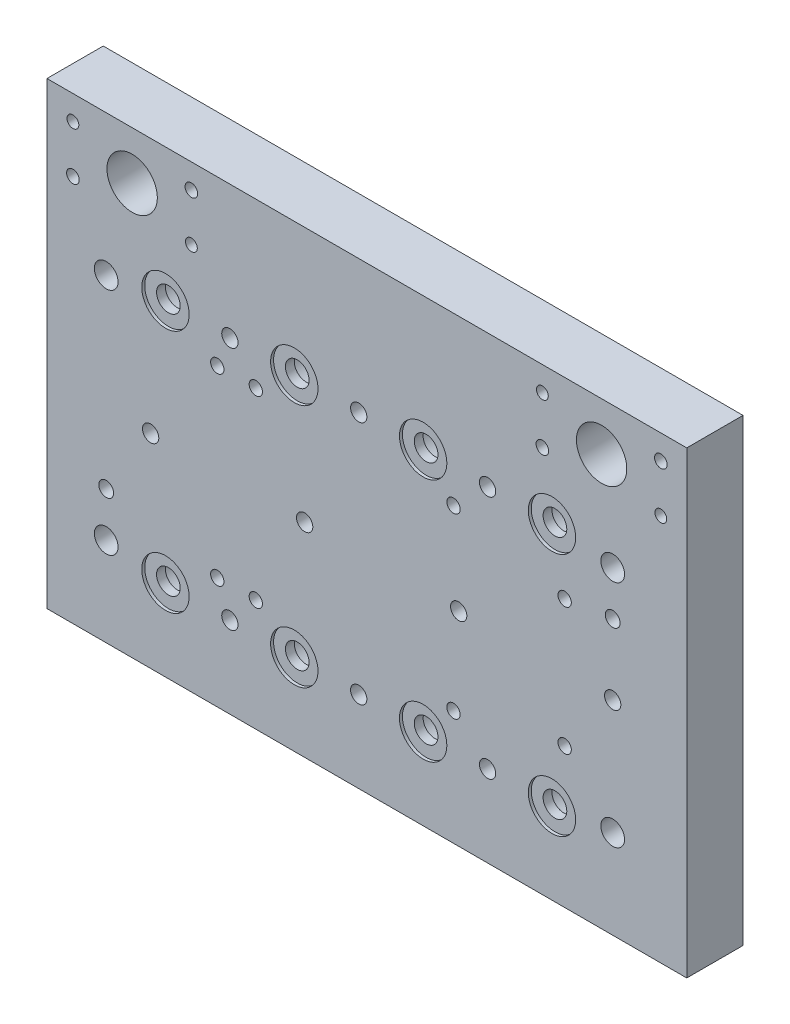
from build123d import *

# Parameters (mm, degrees)
ESQUISSE1_W                                        = 432
ESQUISSE1_H                                        = 310
BASE_EXTRUSION_DEPTH                               = 38
ESQUISSE2_R                                        = 8
ENL_V_MAT_EXTRU_1_DEPTH                            = 24
ESQUISSE4_R                                        = 4
ESQUISSE4_R_2                                      = 4.25
ENL_V_MAT_EXTRU_3_DEPTH                            = 534.074103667
ESQUISSE5_R                                        = 17
ENL_V_MAT_EXTRU_4_DEPTH                            = 534.074103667
ESQUISSE8_R                                        = 16
ENL_V_MAT_EXTRU_5_DEPTH                            = 2
CHAMBRAGE_POUR_VIS_T_TE_CYLINDRIQUE_D              = 11
CHAMBRAGE_POUR_VIS_T_TE_CYLINDRIQUE_CBORE_D        = 18
CHAMBRAGE_POUR_VIS_T_TE_CYLINDRIQUE_CBORE_DEPTH    = 10
R_P_TITION_LIN_AIRE1_COUNT                         = 2
R_P_TITION_LIN_AIRE1_PITCH                         = 342
R_P_TITION_LIN_AIRE1_COUNT_DIR2                    = 2
R_P_TITION_LIN_AIRE1_PITCH_DIR2                    = 155
CHAMBRAGE_POUR_VIS_T_TE_HEXAGONALE_M10_D           = 11
CHAMBRAGE_POUR_VIS_T_TE_HEXAGONALE_M10_CBORE_D     = 18
CHAMBRAGE_POUR_VIS_T_TE_HEXAGONALE_M10_CBORE_DEPTH = 10
ESQUISSE15_R                                       = 5
ENL_V_MAT_EXTRU_6_DEPTH                            = 534.074103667
ESQUISSE16_R                                       = 8
ENL_V_MAT_EXTRU_7_DEPTH                            = 533.935268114
ENL_V_START                                        = -30
ESQUISSE17_R                                       = 16
ENL_V_MAT_EXTRU_8_DEPTH                            = 30
CHAMBRAGE_POUR_VIS_T_TE_CYLINDRIQU_2_D             = 9
CHAMBRAGE_POUR_VIS_T_TE_CYLINDRIQU_2_CBORE_D       = 15
CHAMBRAGE_POUR_VIS_T_TE_CYLINDRIQU_2_CBORE_DEPTH   = 8


with BuildPart() as part:
    # Esquisse1 → Base-Extrusion (new body)
    with BuildSketch(Plane.XY):
        with Locations((216, -155)):
            Rectangle(ESQUISSE1_W, ESQUISSE1_H)
    extrude(amount=BASE_EXTRUSION_DEPTH)

    # Esquisse2 → Enl_v. mat.-Extru.1 (cut)
    with BuildSketch(Plane.XY.offset(38)):
        with Locations((40, -250)):
            Circle(ESQUISSE2_R)
        with Locations((40, -95)):
            Circle(ESQUISSE2_R)
        with Locations((382, -95)):
            Circle(ESQUISSE2_R)
        with Locations((382, -250)):
            Circle(ESQUISSE2_R)
    extrude(amount=-ENL_V_MAT_EXTRU_1_DEPTH, mode=Mode.SUBTRACT)

    # Esquisse4 → Enl_v. mat.-Extru.3 (cut, through all)
    with BuildSketch(Plane(origin=(0, 0, 0), x_dir=(-1, 0, 0), z_dir=(0, 0, -1))):
        with Locations((-334.5, -16.5)):
            Circle(ESQUISSE4_R)
        with Locations((-414.5, -48.5)):
            Circle(ESQUISSE4_R)
        with Locations((-334.5, -48.5)):
            Circle(ESQUISSE4_R_2)
        with Locations((-414.5, -16.5)):
            Circle(ESQUISSE4_R_2)
        with Locations((-17.5, -16.5)):
            Circle(ESQUISSE4_R)
        with Locations((-97.5, -48.5)):
            Circle(ESQUISSE4_R)
        with Locations((-17.5, -48.5)):
            Circle(ESQUISSE4_R_2)
        with Locations((-97.5, -16.5)):
            Circle(ESQUISSE4_R_2)
    extrude(amount=-ENL_V_MAT_EXTRU_3_DEPTH, mode=Mode.SUBTRACT)

    # Esquisse5 → Enl_v. mat.-Extru.4 (cut, through all)
    with BuildSketch(Plane(origin=(0, 0, 0), x_dir=(-1, 0, 0), z_dir=(0, 0, -1))):
        with Locations((-57.5, -32.5)):
            Circle(ESQUISSE5_R)
        with Locations((-374.5, -32.5)):
            Circle(ESQUISSE5_R)
    extrude(amount=-ENL_V_MAT_EXTRU_4_DEPTH, mode=Mode.SUBTRACT)

    # Esquisse8 → Enl_v. mat.-Extru.5 (cut)
    with BuildSketch(Plane.XY.offset(38)):
        with Locations((341, -90)):
            Circle(ESQUISSE8_R)
        with Locations((254, -90)):
            Circle(ESQUISSE8_R)
        with Locations((167, -90)):
            Circle(ESQUISSE8_R)
        with Locations((80, -90)):
            Circle(ESQUISSE8_R)
        with Locations((80, -255)):
            Circle(ESQUISSE8_R)
        with Locations((167, -255)):
            Circle(ESQUISSE8_R)
        with Locations((254, -255)):
            Circle(ESQUISSE8_R)
        with Locations((341, -255)):
            Circle(ESQUISSE8_R)
    extrude(amount=-ENL_V_MAT_EXTRU_5_DEPTH, mode=Mode.SUBTRACT)

    # Chambrage pour vis _ t_te cylindrique (through all)
    with Locations(Plane(origin=(0, 0, 0), x_dir=(-1, 0, 0), z_dir=(0, 0, -1))):
        with Locations((-382, -95)):
            chambrage_pour_vis_t_te_cylindrique = CounterBoreHole(CHAMBRAGE_POUR_VIS_T_TE_CYLINDRIQUE_D / 2, CHAMBRAGE_POUR_VIS_T_TE_CYLINDRIQUE_CBORE_D / 2, CHAMBRAGE_POUR_VIS_T_TE_CYLINDRIQUE_CBORE_DEPTH)

    # R_p_tition lin_aire1: Chambrage pour vis _ t_te cylindrique 2 × 2
    with Locations(*[(-i * R_P_TITION_LIN_AIRE1_PITCH, -j * R_P_TITION_LIN_AIRE1_PITCH_DIR2, 0) for i in range(R_P_TITION_LIN_AIRE1_COUNT) for j in range(R_P_TITION_LIN_AIRE1_COUNT_DIR2) if (i, j) != (0, 0)]):
        add(chambrage_pour_vis_t_te_cylindrique, mode=Mode.SUBTRACT)

    # Chambrage pour vis _ t_te hexagonale M10 (through all)
    with Locations(Plane(origin=(0, 0, 0), x_dir=(-1, 0, 0), z_dir=(0, 0, -1))):
        with Locations((-297.5, -90), (-210.5, -90), (-123.5, -90), (-382, -172.5), (-297.5, -255), (-210.5, -255), (-123.5, -255), (-278, -172.5), (-174, -172.5), (-70, -172.5)):
            CounterBoreHole(CHAMBRAGE_POUR_VIS_T_TE_HEXAGONALE_M10_D / 2, CHAMBRAGE_POUR_VIS_T_TE_HEXAGONALE_M10_CBORE_D / 2, CHAMBRAGE_POUR_VIS_T_TE_HEXAGONALE_M10_CBORE_DEPTH)

    # Esquisse15 → Enl_v. mat.-Extru.6 (cut, through all)
    with BuildSketch(Plane.XY.offset(38)):
        with Locations((382, -125)):
            Circle(ESQUISSE15_R)
        with Locations((40, -220)):
            Circle(ESQUISSE15_R)
    extrude(amount=-ENL_V_MAT_EXTRU_6_DEPTH, mode=Mode.SUBTRACT)

    # Esquisse16 → Enl_v. mat.-Extru.7 (cut, through all)
    with BuildSketch(Plane.XY.offset(36)):
        with Locations((80, -90)):
            Circle(ESQUISSE16_R)
        with Locations((167, -90)):
            Circle(ESQUISSE16_R)
        with Locations((254, -90)):
            Circle(ESQUISSE16_R)
        with Locations((341, -90)):
            Circle(ESQUISSE16_R)
        with Locations((341, -255)):
            Circle(ESQUISSE16_R)
        with Locations((254, -255)):
            Circle(ESQUISSE16_R)
        with Locations((167, -255)):
            Circle(ESQUISSE16_R)
        with Locations((80, -255)):
            Circle(ESQUISSE16_R)
    extrude(amount=-ENL_V_MAT_EXTRU_7_DEPTH, mode=Mode.SUBTRACT)

    # Esquisse17 → Enl_v. mat.-Extru.8 (cut)
    with BuildSketch(Plane(origin=(0, 0, 0), x_dir=(-1, 0, 0), z_dir=(0, 0, -1)).offset(ENL_V_START)):
        with Locations(Location((-341, -90, 0), (0, 0, 180))):
            Circle(ESQUISSE17_R)
        with Locations(Location((-254, -90, 0), (0, 0, 180))):
            Circle(ESQUISSE17_R)
        with Locations(Location((-167, -90, 0), (0, 0, 180))):
            Circle(ESQUISSE17_R)
        with Locations(Location((-80, -90, 0), (0, 0, 180))):
            Circle(ESQUISSE17_R)
        with Locations(Location((-341, -255, 0), (0, 0, 180))):
            Circle(ESQUISSE17_R)
        with Locations(Location((-254, -255, 0), (0, 0, 180))):
            Circle(ESQUISSE17_R)
        with Locations(Location((-167, -255, 0), (0, 0, 180))):
            Circle(ESQUISSE17_R)
        with Locations(Location((-80, -255, 0), (0, 0, 180))):
            Circle(ESQUISSE17_R)
    extrude(amount=ENL_V_MAT_EXTRU_8_DEPTH, mode=Mode.SUBTRACT)

    # Chambrage pour vis _ t_te cylindriqu 2 (through all)
    with Locations(Plane(origin=(0, 0, 0), x_dir=(-1, 0, 0), z_dir=(0, 0, -1))):
        with Locations((-274.5, -112.5), (-349.551704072, -129.5), (-274.5, -232.5), (-115, -234.5), (-115, -110.5), (-349.551704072, -215.5), (-141, -234.5), (-141, -110.5)):
            CounterBoreHole(CHAMBRAGE_POUR_VIS_T_TE_CYLINDRIQU_2_D / 2, CHAMBRAGE_POUR_VIS_T_TE_CYLINDRIQU_2_CBORE_D / 2, CHAMBRAGE_POUR_VIS_T_TE_CYLINDRIQU_2_CBORE_DEPTH)


solid = part.part
